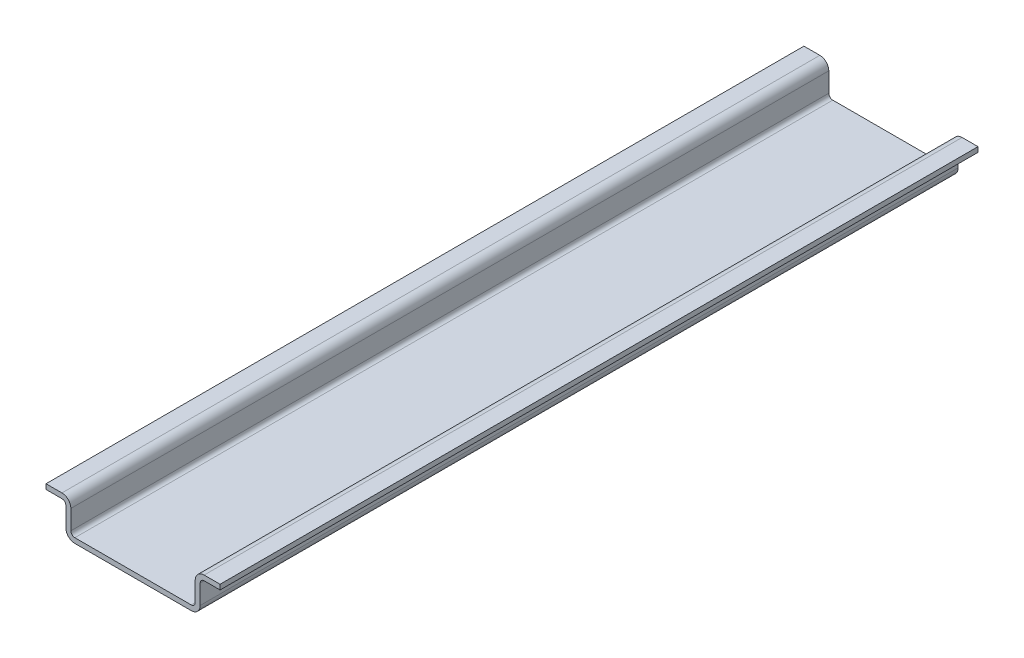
ISO-10303-21;
HEADER;
FILE_DESCRIPTION(('STEP AP214'),'2;1');
FILE_NAME('part.step','',(''),(''),'','','');
FILE_SCHEMA(('AUTOMOTIVE_DESIGN { 1 0 10303 214 1 1 1 1 }'));
ENDSEC;
DATA;
#1=APPLICATION_CONTEXT('core data for automotive mechanical design processes');
#2=APPLICATION_PROTOCOL_DEFINITION('international standard','automotive_design',2000,#1);
#3=PRODUCT_CONTEXT('',#1,'mechanical');
#4=PRODUCT('Part','Part','',(#3));
#5=PRODUCT_RELATED_PRODUCT_CATEGORY('part','',(#4));
#6=PRODUCT_DEFINITION_FORMATION('','',#4);
#7=PRODUCT_DEFINITION_CONTEXT('part definition',#1,'design');
#8=PRODUCT_DEFINITION('design','',#6,#7);
#9=PRODUCT_DEFINITION_SHAPE('','',#8);
#10=(LENGTH_UNIT() NAMED_UNIT(*) SI_UNIT(.MILLI.,.METRE.));
#11=(NAMED_UNIT(*) PLANE_ANGLE_UNIT() SI_UNIT($,.RADIAN.));
#12=(NAMED_UNIT(*) SI_UNIT($,.STERADIAN.) SOLID_ANGLE_UNIT());
#13=UNCERTAINTY_MEASURE_WITH_UNIT(LENGTH_MEASURE(1.E-05),#10,'distance_accuracy_value','');
#14=(GEOMETRIC_REPRESENTATION_CONTEXT(3) GLOBAL_UNCERTAINTY_ASSIGNED_CONTEXT((#13)) GLOBAL_UNIT_ASSIGNED_CONTEXT((#10,
#11,#12)) REPRESENTATION_CONTEXT('',''));
#15=CARTESIAN_POINT('',(0.,0.,0.));
#16=DIRECTION('',(0.,0.,1.));
#17=DIRECTION('',(1.,0.,0.));
#18=AXIS2_PLACEMENT_3D('',#15,#16,#17);
#19=CARTESIAN_POINT('',(17.5,7.5,76.2));
#20=DIRECTION('',(-1.,0.,0.));
#21=DIRECTION('',(0.,0.,1.));
#22=AXIS2_PLACEMENT_3D('',#19,#20,#21);
#23=PLANE('',#22);
#24=DIRECTION('',(0.,1.,0.));
#25=VECTOR('',#24,1.);
#26=CARTESIAN_POINT('',(17.5,7.5,-76.2));
#27=LINE('',#26,#25);
#28=CARTESIAN_POINT('',(17.5,6.5,-76.2));
#29=VERTEX_POINT('',#28);
#30=CARTESIAN_POINT('',(17.5,7.5,-76.2));
#31=VERTEX_POINT('',#30);
#32=EDGE_CURVE('E174',#29,#31,#27,.T.);
#33=ORIENTED_EDGE('',*,*,#32,.T.);
#34=DIRECTION('',(0.,0.,-1.));
#35=VECTOR('',#34,1.);
#36=CARTESIAN_POINT('',(17.5,7.5,76.2));
#37=LINE('',#36,#35);
#38=CARTESIAN_POINT('',(17.5,7.5,76.2));
#39=VERTEX_POINT('',#38);
#40=EDGE_CURVE('E11',#39,#31,#37,.T.);
#41=ORIENTED_EDGE('',*,*,#40,.F.);
#42=DIRECTION('',(0.,1.,0.));
#43=VECTOR('',#42,1.);
#44=CARTESIAN_POINT('',(17.5,7.5,76.2));
#45=LINE('',#44,#43);
#46=CARTESIAN_POINT('',(17.5,6.5,76.2));
#47=VERTEX_POINT('',#46);
#48=EDGE_CURVE('E225',#47,#39,#45,.T.);
#49=ORIENTED_EDGE('',*,*,#48,.F.);
#50=DIRECTION('',(0.,0.,-1.));
#51=VECTOR('',#50,1.);
#52=CARTESIAN_POINT('',(17.5,6.5,76.2));
#53=LINE('',#52,#51);
#54=EDGE_CURVE('E187',#47,#29,#53,.T.);
#55=ORIENTED_EDGE('',*,*,#54,.T.);
#56=EDGE_LOOP('',(#33,#41,#49,#55));
#57=FACE_BOUND('',#56,.T.);
#58=ADVANCED_FACE('F34',(#57),#23,.F.);
#59=CARTESIAN_POINT('',(14.3,7.5,76.2));
#60=DIRECTION('',(0.,-1.,0.));
#61=DIRECTION('',(0.,0.,-1.));
#62=AXIS2_PLACEMENT_3D('',#59,#60,#61);
#63=PLANE('',#62);
#64=DIRECTION('',(-1.,0.,0.));
#65=VECTOR('',#64,1.);
#66=CARTESIAN_POINT('',(14.3,7.5,-76.2));
#67=LINE('',#66,#65);
#68=CARTESIAN_POINT('',(14.3,7.5,-76.2));
#69=VERTEX_POINT('',#68);
#70=EDGE_CURVE('E170',#31,#69,#67,.T.);
#71=ORIENTED_EDGE('',*,*,#70,.T.);
#72=DIRECTION('',(0.,0.,-1.));
#73=VECTOR('',#72,1.);
#74=CARTESIAN_POINT('',(14.3,7.5,76.2));
#75=LINE('',#74,#73);
#76=CARTESIAN_POINT('',(14.3,7.5,76.2));
#77=VERTEX_POINT('',#76);
#78=EDGE_CURVE('E41',#77,#69,#75,.T.);
#79=ORIENTED_EDGE('',*,*,#78,.F.);
#80=DIRECTION('',(-1.,0.,0.));
#81=VECTOR('',#80,1.);
#82=CARTESIAN_POINT('',(14.3,7.5,76.2));
#83=LINE('',#82,#81);
#84=EDGE_CURVE('E183',#39,#77,#83,.T.);
#85=ORIENTED_EDGE('',*,*,#84,.F.);
#86=ORIENTED_EDGE('',*,*,#40,.T.);
#87=EDGE_LOOP('',(#71,#79,#85,#86));
#88=FACE_BOUND('',#87,.T.);
#89=ADVANCED_FACE('F182',(#88),#63,.F.);
#90=CARTESIAN_POINT('',(14.3,5.7,76.2));
#91=DIRECTION('',(0.,0.,-1.));
#92=DIRECTION('',(-1.,0.,0.));
#93=AXIS2_PLACEMENT_3D('',#90,#91,#92);
#94=CYLINDRICAL_SURFACE('',#93,1.8);
#95=CARTESIAN_POINT('',(14.3,5.7,-76.2));
#96=DIRECTION('',(0.,0.,1.));
#97=DIRECTION('',(-1.,0.,0.));
#98=AXIS2_PLACEMENT_3D('',#95,#96,#97);
#99=CIRCLE('',#98,1.8);
#100=CARTESIAN_POINT('',(12.5,5.7,-76.2));
#101=VERTEX_POINT('',#100);
#102=EDGE_CURVE('E176',#69,#101,#99,.T.);
#103=ORIENTED_EDGE('',*,*,#102,.T.);
#104=DIRECTION('',(0.,0.,-1.));
#105=VECTOR('',#104,1.);
#106=CARTESIAN_POINT('',(12.5,5.7,76.2));
#107=LINE('',#106,#105);
#108=CARTESIAN_POINT('',(12.5,5.7,76.2));
#109=VERTEX_POINT('',#108);
#110=EDGE_CURVE('E311',#109,#101,#107,.T.);
#111=ORIENTED_EDGE('',*,*,#110,.F.);
#112=CARTESIAN_POINT('',(14.3,5.7,76.2));
#113=DIRECTION('',(0.,0.,1.));
#114=DIRECTION('',(-1.,0.,0.));
#115=AXIS2_PLACEMENT_3D('',#112,#113,#114);
#116=CIRCLE('',#115,1.8);
#117=EDGE_CURVE('E228',#77,#109,#116,.T.);
#118=ORIENTED_EDGE('',*,*,#117,.F.);
#119=ORIENTED_EDGE('',*,*,#78,.T.);
#120=EDGE_LOOP('',(#103,#111,#118,#119));
#121=FACE_BOUND('',#120,.T.);
#122=ADVANCED_FACE('F315',(#121),#94,.T.);
#123=CARTESIAN_POINT('',(12.5,1.8,76.2));
#124=DIRECTION('',(1.,0.,0.));
#125=DIRECTION('',(0.,1.,0.));
#126=AXIS2_PLACEMENT_3D('',#123,#124,#125);
#127=PLANE('',#126);
#128=DIRECTION('',(0.,-1.,0.));
#129=VECTOR('',#128,1.);
#130=CARTESIAN_POINT('',(12.5,1.8,-76.2));
#131=LINE('',#130,#129);
#132=CARTESIAN_POINT('',(12.5,1.8,-76.2));
#133=VERTEX_POINT('',#132);
#134=EDGE_CURVE('E191',#101,#133,#131,.T.);
#135=ORIENTED_EDGE('',*,*,#134,.T.);
#136=DIRECTION('',(0.,0.,-1.));
#137=VECTOR('',#136,1.);
#138=CARTESIAN_POINT('',(12.5,1.8,76.2));
#139=LINE('',#138,#137);
#140=CARTESIAN_POINT('',(12.5,1.8,76.2));
#141=VERTEX_POINT('',#140);
#142=EDGE_CURVE('E308',#141,#133,#139,.T.);
#143=ORIENTED_EDGE('',*,*,#142,.F.);
#144=DIRECTION('',(0.,-1.,0.));
#145=VECTOR('',#144,1.);
#146=CARTESIAN_POINT('',(12.5,1.8,76.2));
#147=LINE('',#146,#145);
#148=EDGE_CURVE('E230',#109,#141,#147,.T.);
#149=ORIENTED_EDGE('',*,*,#148,.F.);
#150=ORIENTED_EDGE('',*,*,#110,.T.);
#151=EDGE_LOOP('',(#135,#143,#149,#150));
#152=FACE_BOUND('',#151,.T.);
#153=ADVANCED_FACE('F323',(#152),#127,.F.);
#154=CARTESIAN_POINT('',(11.7,1.8,76.2));
#155=DIRECTION('',(0.,0.,-1.));
#156=DIRECTION('',(-1.,0.,0.));
#157=AXIS2_PLACEMENT_3D('',#154,#155,#156);
#158=CYLINDRICAL_SURFACE('',#157,0.800000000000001);
#159=CARTESIAN_POINT('',(11.7,1.8,-76.2));
#160=DIRECTION('',(0.,0.,-1.));
#161=DIRECTION('',(1.,0.,0.));
#162=AXIS2_PLACEMENT_3D('',#159,#160,#161);
#163=CIRCLE('',#162,0.800000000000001);
#164=CARTESIAN_POINT('',(11.7,0.999999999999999,-76.2));
#165=VERTEX_POINT('',#164);
#166=EDGE_CURVE('E193',#133,#165,#163,.T.);
#167=ORIENTED_EDGE('',*,*,#166,.T.);
#168=DIRECTION('',(0.,0.,-1.));
#169=VECTOR('',#168,1.);
#170=CARTESIAN_POINT('',(11.7,0.999999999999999,76.2));
#171=LINE('',#170,#169);
#172=CARTESIAN_POINT('',(11.7,0.999999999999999,76.2));
#173=VERTEX_POINT('',#172);
#174=EDGE_CURVE('E305',#173,#165,#171,.T.);
#175=ORIENTED_EDGE('',*,*,#174,.F.);
#176=CARTESIAN_POINT('',(11.7,1.8,76.2));
#177=DIRECTION('',(0.,0.,-1.));
#178=DIRECTION('',(1.,0.,0.));
#179=AXIS2_PLACEMENT_3D('',#176,#177,#178);
#180=CIRCLE('',#179,0.800000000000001);
#181=EDGE_CURVE('E232',#141,#173,#180,.T.);
#182=ORIENTED_EDGE('',*,*,#181,.F.);
#183=ORIENTED_EDGE('',*,*,#142,.T.);
#184=EDGE_LOOP('',(#167,#175,#182,#183));
#185=FACE_BOUND('',#184,.T.);
#186=ADVANCED_FACE('F326',(#185),#158,.F.);
#187=CARTESIAN_POINT('',(-11.7,1.,76.2));
#188=DIRECTION('',(0.,-1.,0.));
#189=DIRECTION('',(1.,0.,0.));
#190=AXIS2_PLACEMENT_3D('',#187,#188,#189);
#191=PLANE('',#190);
#192=DIRECTION('',(-1.,0.,0.));
#193=VECTOR('',#192,1.);
#194=CARTESIAN_POINT('',(-11.7,1.,-76.2));
#195=LINE('',#194,#193);
#196=CARTESIAN_POINT('',(-11.7,1.,-76.2));
#197=VERTEX_POINT('',#196);
#198=EDGE_CURVE('E195',#165,#197,#195,.T.);
#199=ORIENTED_EDGE('',*,*,#198,.T.);
#200=DIRECTION('',(0.,0.,-1.));
#201=VECTOR('',#200,1.);
#202=CARTESIAN_POINT('',(-11.7,1.,76.2));
#203=LINE('',#202,#201);
#204=CARTESIAN_POINT('',(-11.7,1.,76.2));
#205=VERTEX_POINT('',#204);
#206=EDGE_CURVE('E302',#205,#197,#203,.T.);
#207=ORIENTED_EDGE('',*,*,#206,.F.);
#208=DIRECTION('',(-1.,0.,0.));
#209=VECTOR('',#208,1.);
#210=CARTESIAN_POINT('',(-11.7,1.,76.2));
#211=LINE('',#210,#209);
#212=EDGE_CURVE('E234',#173,#205,#211,.T.);
#213=ORIENTED_EDGE('',*,*,#212,.F.);
#214=ORIENTED_EDGE('',*,*,#174,.T.);
#215=EDGE_LOOP('',(#199,#207,#213,#214));
#216=FACE_BOUND('',#215,.T.);
#217=ADVANCED_FACE('F331',(#216),#191,.F.);
#218=CARTESIAN_POINT('',(-11.7,1.8,76.2));
#219=DIRECTION('',(0.,0.,-1.));
#220=DIRECTION('',(-1.,0.,0.));
#221=AXIS2_PLACEMENT_3D('',#218,#219,#220);
#222=CYLINDRICAL_SURFACE('',#221,0.800000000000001);
#223=CARTESIAN_POINT('',(-11.7,1.8,-76.2));
#224=DIRECTION('',(0.,0.,-1.));
#225=DIRECTION('',(-1.,0.,0.));
#226=AXIS2_PLACEMENT_3D('',#223,#224,#225);
#227=CIRCLE('',#226,0.800000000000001);
#228=CARTESIAN_POINT('',(-12.5,1.8,-76.2));
#229=VERTEX_POINT('',#228);
#230=EDGE_CURVE('E197',#197,#229,#227,.T.);
#231=ORIENTED_EDGE('',*,*,#230,.T.);
#232=DIRECTION('',(0.,0.,-1.));
#233=VECTOR('',#232,1.);
#234=CARTESIAN_POINT('',(-12.5,1.8,76.2));
#235=LINE('',#234,#233);
#236=CARTESIAN_POINT('',(-12.5,1.8,76.2));
#237=VERTEX_POINT('',#236);
#238=EDGE_CURVE('E299',#237,#229,#235,.T.);
#239=ORIENTED_EDGE('',*,*,#238,.F.);
#240=CARTESIAN_POINT('',(-11.7,1.8,76.2));
#241=DIRECTION('',(0.,0.,-1.));
#242=DIRECTION('',(-1.,0.,0.));
#243=AXIS2_PLACEMENT_3D('',#240,#241,#242);
#244=CIRCLE('',#243,0.800000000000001);
#245=EDGE_CURVE('E236',#205,#237,#244,.T.);
#246=ORIENTED_EDGE('',*,*,#245,.F.);
#247=ORIENTED_EDGE('',*,*,#206,.T.);
#248=EDGE_LOOP('',(#231,#239,#246,#247));
#249=FACE_BOUND('',#248,.T.);
#250=ADVANCED_FACE('F337',(#249),#222,.F.);
#251=CARTESIAN_POINT('',(-12.5,1.8,76.2));
#252=DIRECTION('',(-1.,0.,0.));
#253=DIRECTION('',(0.,-1.,0.));
#254=AXIS2_PLACEMENT_3D('',#251,#252,#253);
#255=PLANE('',#254);
#256=DIRECTION('',(0.,1.,0.));
#257=VECTOR('',#256,1.);
#258=CARTESIAN_POINT('',(-12.5,1.8,-76.2));
#259=LINE('',#258,#257);
#260=CARTESIAN_POINT('',(-12.5,5.7,-76.2));
#261=VERTEX_POINT('',#260);
#262=EDGE_CURVE('E199',#229,#261,#259,.T.);
#263=ORIENTED_EDGE('',*,*,#262,.T.);
#264=DIRECTION('',(0.,0.,-1.));
#265=VECTOR('',#264,1.);
#266=CARTESIAN_POINT('',(-12.5,5.7,76.2));
#267=LINE('',#266,#265);
#268=CARTESIAN_POINT('',(-12.5,5.7,76.2));
#269=VERTEX_POINT('',#268);
#270=EDGE_CURVE('E296',#269,#261,#267,.T.);
#271=ORIENTED_EDGE('',*,*,#270,.F.);
#272=DIRECTION('',(0.,1.,0.));
#273=VECTOR('',#272,1.);
#274=CARTESIAN_POINT('',(-12.5,1.8,76.2));
#275=LINE('',#274,#273);
#276=EDGE_CURVE('E238',#237,#269,#275,.T.);
#277=ORIENTED_EDGE('',*,*,#276,.F.);
#278=ORIENTED_EDGE('',*,*,#238,.T.);
#279=EDGE_LOOP('',(#263,#271,#277,#278));
#280=FACE_BOUND('',#279,.T.);
#281=ADVANCED_FACE('F341',(#280),#255,.F.);
#282=CARTESIAN_POINT('',(-14.3,5.7,76.2));
#283=DIRECTION('',(0.,0.,-1.));
#284=DIRECTION('',(-1.,0.,0.));
#285=AXIS2_PLACEMENT_3D('',#282,#283,#284);
#286=CYLINDRICAL_SURFACE('',#285,1.8);
#287=CARTESIAN_POINT('',(-14.3,5.7,-76.2));
#288=DIRECTION('',(0.,0.,1.));
#289=DIRECTION('',(1.,0.,0.));
#290=AXIS2_PLACEMENT_3D('',#287,#288,#289);
#291=CIRCLE('',#290,1.8);
#292=CARTESIAN_POINT('',(-14.3,7.5,-76.2));
#293=VERTEX_POINT('',#292);
#294=EDGE_CURVE('E201',#261,#293,#291,.T.);
#295=ORIENTED_EDGE('',*,*,#294,.T.);
#296=DIRECTION('',(0.,0.,-1.));
#297=VECTOR('',#296,1.);
#298=CARTESIAN_POINT('',(-14.3,7.5,76.2));
#299=LINE('',#298,#297);
#300=CARTESIAN_POINT('',(-14.3,7.5,76.2));
#301=VERTEX_POINT('',#300);
#302=EDGE_CURVE('E293',#301,#293,#299,.T.);
#303=ORIENTED_EDGE('',*,*,#302,.F.);
#304=CARTESIAN_POINT('',(-14.3,5.7,76.2));
#305=DIRECTION('',(0.,0.,1.));
#306=DIRECTION('',(1.,0.,0.));
#307=AXIS2_PLACEMENT_3D('',#304,#305,#306);
#308=CIRCLE('',#307,1.8);
#309=EDGE_CURVE('E240',#269,#301,#308,.T.);
#310=ORIENTED_EDGE('',*,*,#309,.F.);
#311=ORIENTED_EDGE('',*,*,#270,.T.);
#312=EDGE_LOOP('',(#295,#303,#310,#311));
#313=FACE_BOUND('',#312,.T.);
#314=ADVANCED_FACE('F346',(#313),#286,.T.);
#315=CARTESIAN_POINT('',(-14.3,7.5,76.2));
#316=DIRECTION('',(0.,-1.,0.));
#317=DIRECTION('',(1.,0.,0.));
#318=AXIS2_PLACEMENT_3D('',#315,#316,#317);
#319=PLANE('',#318);
#320=DIRECTION('',(-1.,0.,0.));
#321=VECTOR('',#320,1.);
#322=CARTESIAN_POINT('',(-14.3,7.5,-76.2));
#323=LINE('',#322,#321);
#324=CARTESIAN_POINT('',(-17.5,7.5,-76.2));
#325=VERTEX_POINT('',#324);
#326=EDGE_CURVE('E203',#293,#325,#323,.T.);
#327=ORIENTED_EDGE('',*,*,#326,.T.);
#328=DIRECTION('',(0.,0.,-1.));
#329=VECTOR('',#328,1.);
#330=CARTESIAN_POINT('',(-17.5,7.5,76.2));
#331=LINE('',#330,#329);
#332=CARTESIAN_POINT('',(-17.5,7.5,76.2));
#333=VERTEX_POINT('',#332);
#334=EDGE_CURVE('E290',#333,#325,#331,.T.);
#335=ORIENTED_EDGE('',*,*,#334,.F.);
#336=DIRECTION('',(-1.,0.,0.));
#337=VECTOR('',#336,1.);
#338=CARTESIAN_POINT('',(-14.3,7.5,76.2));
#339=LINE('',#338,#337);
#340=EDGE_CURVE('E242',#301,#333,#339,.T.);
#341=ORIENTED_EDGE('',*,*,#340,.F.);
#342=ORIENTED_EDGE('',*,*,#302,.T.);
#343=EDGE_LOOP('',(#327,#335,#341,#342));
#344=FACE_BOUND('',#343,.T.);
#345=ADVANCED_FACE('F352',(#344),#319,.F.);
#346=CARTESIAN_POINT('',(-17.5,7.5,76.2));
#347=DIRECTION('',(1.,0.,0.));
#348=DIRECTION('',(0.,0.,-1.));
#349=AXIS2_PLACEMENT_3D('',#346,#347,#348);
#350=PLANE('',#349);
#351=DIRECTION('',(0.,-1.,0.));
#352=VECTOR('',#351,1.);
#353=CARTESIAN_POINT('',(-17.5,7.5,-76.2));
#354=LINE('',#353,#352);
#355=CARTESIAN_POINT('',(-17.5,6.5,-76.2));
#356=VERTEX_POINT('',#355);
#357=EDGE_CURVE('E205',#325,#356,#354,.T.);
#358=ORIENTED_EDGE('',*,*,#357,.T.);
#359=DIRECTION('',(0.,0.,-1.));
#360=VECTOR('',#359,1.);
#361=CARTESIAN_POINT('',(-17.5,6.5,76.2));
#362=LINE('',#361,#360);
#363=CARTESIAN_POINT('',(-17.5,6.5,76.2));
#364=VERTEX_POINT('',#363);
#365=EDGE_CURVE('E287',#364,#356,#362,.T.);
#366=ORIENTED_EDGE('',*,*,#365,.F.);
#367=DIRECTION('',(0.,-1.,0.));
#368=VECTOR('',#367,1.);
#369=CARTESIAN_POINT('',(-17.5,7.5,76.2));
#370=LINE('',#369,#368);
#371=EDGE_CURVE('E244',#333,#364,#370,.T.);
#372=ORIENTED_EDGE('',*,*,#371,.F.);
#373=ORIENTED_EDGE('',*,*,#334,.T.);
#374=EDGE_LOOP('',(#358,#366,#372,#373));
#375=FACE_BOUND('',#374,.T.);
#376=ADVANCED_FACE('F356',(#375),#350,.F.);
#377=CARTESIAN_POINT('',(-14.3,6.5,76.2));
#378=DIRECTION('',(0.,1.,0.));
#379=DIRECTION('',(-1.,0.,0.));
#380=AXIS2_PLACEMENT_3D('',#377,#378,#379);
#381=PLANE('',#380);
#382=DIRECTION('',(1.,0.,0.));
#383=VECTOR('',#382,1.);
#384=CARTESIAN_POINT('',(-14.3,6.5,-76.2));
#385=LINE('',#384,#383);
#386=CARTESIAN_POINT('',(-14.3,6.5,-76.2));
#387=VERTEX_POINT('',#386);
#388=EDGE_CURVE('E207',#356,#387,#385,.T.);
#389=ORIENTED_EDGE('',*,*,#388,.T.);
#390=DIRECTION('',(0.,0.,-1.));
#391=VECTOR('',#390,1.);
#392=CARTESIAN_POINT('',(-14.3,6.5,76.2));
#393=LINE('',#392,#391);
#394=CARTESIAN_POINT('',(-14.3,6.5,76.2));
#395=VERTEX_POINT('',#394);
#396=EDGE_CURVE('E284',#395,#387,#393,.T.);
#397=ORIENTED_EDGE('',*,*,#396,.F.);
#398=DIRECTION('',(1.,0.,0.));
#399=VECTOR('',#398,1.);
#400=CARTESIAN_POINT('',(-14.3,6.5,76.2));
#401=LINE('',#400,#399);
#402=EDGE_CURVE('E246',#364,#395,#401,.T.);
#403=ORIENTED_EDGE('',*,*,#402,.F.);
#404=ORIENTED_EDGE('',*,*,#365,.T.);
#405=EDGE_LOOP('',(#389,#397,#403,#404));
#406=FACE_BOUND('',#405,.T.);
#407=ADVANCED_FACE('F361',(#406),#381,.F.);
#408=CARTESIAN_POINT('',(-14.3,5.7,76.2));
#409=DIRECTION('',(0.,0.,-1.));
#410=DIRECTION('',(-1.,0.,0.));
#411=AXIS2_PLACEMENT_3D('',#408,#409,#410);
#412=CYLINDRICAL_SURFACE('',#411,0.799999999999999);
#413=CARTESIAN_POINT('',(-14.3,5.7,-76.2));
#414=DIRECTION('',(0.,0.,-1.));
#415=DIRECTION('',(1.,0.,0.));
#416=AXIS2_PLACEMENT_3D('',#413,#414,#415);
#417=CIRCLE('',#416,0.799999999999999);
#418=CARTESIAN_POINT('',(-13.5,5.7,-76.2));
#419=VERTEX_POINT('',#418);
#420=EDGE_CURVE('E209',#387,#419,#417,.T.);
#421=ORIENTED_EDGE('',*,*,#420,.T.);
#422=DIRECTION('',(0.,0.,-1.));
#423=VECTOR('',#422,1.);
#424=CARTESIAN_POINT('',(-13.5,5.7,76.2));
#425=LINE('',#424,#423);
#426=CARTESIAN_POINT('',(-13.5,5.7,76.2));
#427=VERTEX_POINT('',#426);
#428=EDGE_CURVE('E281',#427,#419,#425,.T.);
#429=ORIENTED_EDGE('',*,*,#428,.F.);
#430=CARTESIAN_POINT('',(-14.3,5.7,76.2));
#431=DIRECTION('',(0.,0.,-1.));
#432=DIRECTION('',(1.,0.,0.));
#433=AXIS2_PLACEMENT_3D('',#430,#431,#432);
#434=CIRCLE('',#433,0.799999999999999);
#435=EDGE_CURVE('E248',#395,#427,#434,.T.);
#436=ORIENTED_EDGE('',*,*,#435,.F.);
#437=ORIENTED_EDGE('',*,*,#396,.T.);
#438=EDGE_LOOP('',(#421,#429,#436,#437));
#439=FACE_BOUND('',#438,.T.);
#440=ADVANCED_FACE('F367',(#439),#412,.F.);
#441=CARTESIAN_POINT('',(-13.5,1.8,76.2));
#442=DIRECTION('',(1.,0.,0.));
#443=DIRECTION('',(0.,0.,-1.));
#444=AXIS2_PLACEMENT_3D('',#441,#442,#443);
#445=PLANE('',#444);
#446=DIRECTION('',(0.,-1.,0.));
#447=VECTOR('',#446,1.);
#448=CARTESIAN_POINT('',(-13.5,1.8,-76.2));
#449=LINE('',#448,#447);
#450=CARTESIAN_POINT('',(-13.5,1.8,-76.2));
#451=VERTEX_POINT('',#450);
#452=EDGE_CURVE('E211',#419,#451,#449,.T.);
#453=ORIENTED_EDGE('',*,*,#452,.T.);
#454=DIRECTION('',(0.,0.,-1.));
#455=VECTOR('',#454,1.);
#456=CARTESIAN_POINT('',(-13.5,1.8,76.2));
#457=LINE('',#456,#455);
#458=CARTESIAN_POINT('',(-13.5,1.8,76.2));
#459=VERTEX_POINT('',#458);
#460=EDGE_CURVE('E278',#459,#451,#457,.T.);
#461=ORIENTED_EDGE('',*,*,#460,.F.);
#462=DIRECTION('',(0.,-1.,0.));
#463=VECTOR('',#462,1.);
#464=CARTESIAN_POINT('',(-13.5,1.8,76.2));
#465=LINE('',#464,#463);
#466=EDGE_CURVE('E250',#427,#459,#465,.T.);
#467=ORIENTED_EDGE('',*,*,#466,.F.);
#468=ORIENTED_EDGE('',*,*,#428,.T.);
#469=EDGE_LOOP('',(#453,#461,#467,#468));
#470=FACE_BOUND('',#469,.T.);
#471=ADVANCED_FACE('F371',(#470),#445,.F.);
#472=CARTESIAN_POINT('',(-11.7,1.8,76.2));
#473=DIRECTION('',(0.,0.,-1.));
#474=DIRECTION('',(-1.,0.,0.));
#475=AXIS2_PLACEMENT_3D('',#472,#473,#474);
#476=CYLINDRICAL_SURFACE('',#475,1.8);
#477=CARTESIAN_POINT('',(-11.7,1.8,-76.2));
#478=DIRECTION('',(0.,0.,1.));
#479=DIRECTION('',(-1.,0.,0.));
#480=AXIS2_PLACEMENT_3D('',#477,#478,#479);
#481=CIRCLE('',#480,1.8);
#482=CARTESIAN_POINT('',(-11.7,0.,-76.2));
#483=VERTEX_POINT('',#482);
#484=EDGE_CURVE('E213',#451,#483,#481,.T.);
#485=ORIENTED_EDGE('',*,*,#484,.T.);
#486=DIRECTION('',(0.,0.,-1.));
#487=VECTOR('',#486,1.);
#488=CARTESIAN_POINT('',(-11.7,0.,76.2));
#489=LINE('',#488,#487);
#490=CARTESIAN_POINT('',(-11.7,0.,76.2));
#491=VERTEX_POINT('',#490);
#492=EDGE_CURVE('E275',#491,#483,#489,.T.);
#493=ORIENTED_EDGE('',*,*,#492,.F.);
#494=CARTESIAN_POINT('',(-11.7,1.8,76.2));
#495=DIRECTION('',(0.,0.,1.));
#496=DIRECTION('',(-1.,0.,0.));
#497=AXIS2_PLACEMENT_3D('',#494,#495,#496);
#498=CIRCLE('',#497,1.8);
#499=EDGE_CURVE('E252',#459,#491,#498,.T.);
#500=ORIENTED_EDGE('',*,*,#499,.F.);
#501=ORIENTED_EDGE('',*,*,#460,.T.);
#502=EDGE_LOOP('',(#485,#493,#500,#501));
#503=FACE_BOUND('',#502,.T.);
#504=ADVANCED_FACE('F376',(#503),#476,.T.);
#505=CARTESIAN_POINT('',(-11.7,0.,76.2));
#506=DIRECTION('',(0.,1.,0.));
#507=DIRECTION('',(-1.,0.,0.));
#508=AXIS2_PLACEMENT_3D('',#505,#506,#507);
#509=PLANE('',#508);
#510=DIRECTION('',(1.,0.,0.));
#511=VECTOR('',#510,1.);
#512=CARTESIAN_POINT('',(-11.7,0.,-76.2));
#513=LINE('',#512,#511);
#514=CARTESIAN_POINT('',(11.7,0.,-76.2));
#515=VERTEX_POINT('',#514);
#516=EDGE_CURVE('E215',#483,#515,#513,.T.);
#517=ORIENTED_EDGE('',*,*,#516,.T.);
#518=DIRECTION('',(0.,0.,-1.));
#519=VECTOR('',#518,1.);
#520=CARTESIAN_POINT('',(11.7,0.,76.2));
#521=LINE('',#520,#519);
#522=CARTESIAN_POINT('',(11.7,0.,76.2));
#523=VERTEX_POINT('',#522);
#524=EDGE_CURVE('E272',#523,#515,#521,.T.);
#525=ORIENTED_EDGE('',*,*,#524,.F.);
#526=DIRECTION('',(1.,0.,0.));
#527=VECTOR('',#526,1.);
#528=CARTESIAN_POINT('',(-11.7,0.,76.2));
#529=LINE('',#528,#527);
#530=EDGE_CURVE('E254',#491,#523,#529,.T.);
#531=ORIENTED_EDGE('',*,*,#530,.F.);
#532=ORIENTED_EDGE('',*,*,#492,.T.);
#533=EDGE_LOOP('',(#517,#525,#531,#532));
#534=FACE_BOUND('',#533,.T.);
#535=ADVANCED_FACE('F382',(#534),#509,.F.);
#536=CARTESIAN_POINT('',(11.7,1.8,76.2));
#537=DIRECTION('',(0.,0.,-1.));
#538=DIRECTION('',(-1.,0.,0.));
#539=AXIS2_PLACEMENT_3D('',#536,#537,#538);
#540=CYLINDRICAL_SURFACE('',#539,1.8);
#541=CARTESIAN_POINT('',(11.7,1.8,-76.2));
#542=DIRECTION('',(0.,0.,1.));
#543=DIRECTION('',(1.,0.,0.));
#544=AXIS2_PLACEMENT_3D('',#541,#542,#543);
#545=CIRCLE('',#544,1.8);
#546=CARTESIAN_POINT('',(13.5,1.8,-76.2));
#547=VERTEX_POINT('',#546);
#548=EDGE_CURVE('E217',#515,#547,#545,.T.);
#549=ORIENTED_EDGE('',*,*,#548,.T.);
#550=DIRECTION('',(0.,0.,-1.));
#551=VECTOR('',#550,1.);
#552=CARTESIAN_POINT('',(13.5,1.8,76.2));
#553=LINE('',#552,#551);
#554=CARTESIAN_POINT('',(13.5,1.8,76.2));
#555=VERTEX_POINT('',#554);
#556=EDGE_CURVE('E269',#555,#547,#553,.T.);
#557=ORIENTED_EDGE('',*,*,#556,.F.);
#558=CARTESIAN_POINT('',(11.7,1.8,76.2));
#559=DIRECTION('',(0.,0.,1.));
#560=DIRECTION('',(1.,0.,0.));
#561=AXIS2_PLACEMENT_3D('',#558,#559,#560);
#562=CIRCLE('',#561,1.8);
#563=EDGE_CURVE('E256',#523,#555,#562,.T.);
#564=ORIENTED_EDGE('',*,*,#563,.F.);
#565=ORIENTED_EDGE('',*,*,#524,.T.);
#566=EDGE_LOOP('',(#549,#557,#564,#565));
#567=FACE_BOUND('',#566,.T.);
#568=ADVANCED_FACE('F386',(#567),#540,.T.);
#569=CARTESIAN_POINT('',(13.5,1.8,76.2));
#570=DIRECTION('',(-1.,0.,0.));
#571=DIRECTION('',(0.,0.,1.));
#572=AXIS2_PLACEMENT_3D('',#569,#570,#571);
#573=PLANE('',#572);
#574=DIRECTION('',(0.,1.,0.));
#575=VECTOR('',#574,1.);
#576=CARTESIAN_POINT('',(13.5,1.8,-76.2));
#577=LINE('',#576,#575);
#578=CARTESIAN_POINT('',(13.5,5.7,-76.2));
#579=VERTEX_POINT('',#578);
#580=EDGE_CURVE('E219',#547,#579,#577,.T.);
#581=ORIENTED_EDGE('',*,*,#580,.T.);
#582=DIRECTION('',(0.,0.,-1.));
#583=VECTOR('',#582,1.);
#584=CARTESIAN_POINT('',(13.5,5.7,76.2));
#585=LINE('',#584,#583);
#586=CARTESIAN_POINT('',(13.5,5.7,76.2));
#587=VERTEX_POINT('',#586);
#588=EDGE_CURVE('E266',#587,#579,#585,.T.);
#589=ORIENTED_EDGE('',*,*,#588,.F.);
#590=DIRECTION('',(0.,1.,0.));
#591=VECTOR('',#590,1.);
#592=CARTESIAN_POINT('',(13.5,1.8,76.2));
#593=LINE('',#592,#591);
#594=EDGE_CURVE('E258',#555,#587,#593,.T.);
#595=ORIENTED_EDGE('',*,*,#594,.F.);
#596=ORIENTED_EDGE('',*,*,#556,.T.);
#597=EDGE_LOOP('',(#581,#589,#595,#596));
#598=FACE_BOUND('',#597,.T.);
#599=ADVANCED_FACE('F391',(#598),#573,.F.);
#600=CARTESIAN_POINT('',(14.3,5.7,76.2));
#601=DIRECTION('',(0.,0.,-1.));
#602=DIRECTION('',(-1.,0.,0.));
#603=AXIS2_PLACEMENT_3D('',#600,#601,#602);
#604=CYLINDRICAL_SURFACE('',#603,0.799999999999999);
#605=CARTESIAN_POINT('',(14.3,5.7,-76.2));
#606=DIRECTION('',(0.,0.,-1.));
#607=DIRECTION('',(-1.,0.,0.));
#608=AXIS2_PLACEMENT_3D('',#605,#606,#607);
#609=CIRCLE('',#608,0.799999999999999);
#610=CARTESIAN_POINT('',(14.3,6.5,-76.2));
#611=VERTEX_POINT('',#610);
#612=EDGE_CURVE('E221',#579,#611,#609,.T.);
#613=ORIENTED_EDGE('',*,*,#612,.T.);
#614=DIRECTION('',(0.,0.,-1.));
#615=VECTOR('',#614,1.);
#616=CARTESIAN_POINT('',(14.3,6.5,76.2));
#617=LINE('',#616,#615);
#618=CARTESIAN_POINT('',(14.3,6.5,76.2));
#619=VERTEX_POINT('',#618);
#620=EDGE_CURVE('E263',#619,#611,#617,.T.);
#621=ORIENTED_EDGE('',*,*,#620,.F.);
#622=CARTESIAN_POINT('',(14.3,5.7,76.2));
#623=DIRECTION('',(0.,0.,-1.));
#624=DIRECTION('',(-1.,0.,0.));
#625=AXIS2_PLACEMENT_3D('',#622,#623,#624);
#626=CIRCLE('',#625,0.799999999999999);
#627=EDGE_CURVE('E53',#587,#619,#626,.T.);
#628=ORIENTED_EDGE('',*,*,#627,.F.);
#629=ORIENTED_EDGE('',*,*,#588,.T.);
#630=EDGE_LOOP('',(#613,#621,#628,#629));
#631=FACE_BOUND('',#630,.T.);
#632=ADVANCED_FACE('F394',(#631),#604,.F.);
#633=CARTESIAN_POINT('',(14.3,6.5,76.2));
#634=DIRECTION('',(0.,1.,0.));
#635=DIRECTION('',(-1.,0.,0.));
#636=AXIS2_PLACEMENT_3D('',#633,#634,#635);
#637=PLANE('',#636);
#638=DIRECTION('',(1.,0.,0.));
#639=VECTOR('',#638,1.);
#640=CARTESIAN_POINT('',(14.3,6.5,-76.2));
#641=LINE('',#640,#639);
#642=EDGE_CURVE('E223',#611,#29,#641,.T.);
#643=ORIENTED_EDGE('',*,*,#642,.T.);
#644=ORIENTED_EDGE('',*,*,#54,.F.);
#645=DIRECTION('',(1.,0.,0.));
#646=VECTOR('',#645,1.);
#647=CARTESIAN_POINT('',(14.3,6.5,76.2));
#648=LINE('',#647,#646);
#649=EDGE_CURVE('E48',#619,#47,#648,.T.);
#650=ORIENTED_EDGE('',*,*,#649,.F.);
#651=ORIENTED_EDGE('',*,*,#620,.T.);
#652=EDGE_LOOP('',(#643,#644,#650,#651));
#653=FACE_BOUND('',#652,.T.);
#654=ADVANCED_FACE('F396',(#653),#637,.F.);
#655=CARTESIAN_POINT('',(14.3,5.7,76.2));
#656=DIRECTION('',(0.,0.,-1.));
#657=DIRECTION('',(-1.,0.,0.));
#658=AXIS2_PLACEMENT_3D('',#655,#656,#657);
#659=PLANE('',#658);
#660=ORIENTED_EDGE('',*,*,#48,.T.);
#661=ORIENTED_EDGE('',*,*,#84,.T.);
#662=ORIENTED_EDGE('',*,*,#117,.T.);
#663=ORIENTED_EDGE('',*,*,#148,.T.);
#664=ORIENTED_EDGE('',*,*,#181,.T.);
#665=ORIENTED_EDGE('',*,*,#212,.T.);
#666=ORIENTED_EDGE('',*,*,#245,.T.);
#667=ORIENTED_EDGE('',*,*,#276,.T.);
#668=ORIENTED_EDGE('',*,*,#309,.T.);
#669=ORIENTED_EDGE('',*,*,#340,.T.);
#670=ORIENTED_EDGE('',*,*,#371,.T.);
#671=ORIENTED_EDGE('',*,*,#402,.T.);
#672=ORIENTED_EDGE('',*,*,#435,.T.);
#673=ORIENTED_EDGE('',*,*,#466,.T.);
#674=ORIENTED_EDGE('',*,*,#499,.T.);
#675=ORIENTED_EDGE('',*,*,#530,.T.);
#676=ORIENTED_EDGE('',*,*,#563,.T.);
#677=ORIENTED_EDGE('',*,*,#594,.T.);
#678=ORIENTED_EDGE('',*,*,#627,.T.);
#679=ORIENTED_EDGE('',*,*,#649,.T.);
#680=EDGE_LOOP('',(#660,#661,#662,#663,#664,#665,#666,#667,#668,#669,#670,#671,#672,#673,#674,
#675,#676,#677,#678,#679));
#681=FACE_BOUND('',#680,.T.);
#682=ADVANCED_FACE('F318',(#681),#659,.F.);
#683=CARTESIAN_POINT('',(14.3,5.7,-76.2));
#684=DIRECTION('',(0.,0.,-1.));
#685=DIRECTION('',(-1.,0.,0.));
#686=AXIS2_PLACEMENT_3D('',#683,#684,#685);
#687=PLANE('',#686);
#688=ORIENTED_EDGE('',*,*,#32,.F.);
#689=ORIENTED_EDGE('',*,*,#642,.F.);
#690=ORIENTED_EDGE('',*,*,#612,.F.);
#691=ORIENTED_EDGE('',*,*,#580,.F.);
#692=ORIENTED_EDGE('',*,*,#548,.F.);
#693=ORIENTED_EDGE('',*,*,#516,.F.);
#694=ORIENTED_EDGE('',*,*,#484,.F.);
#695=ORIENTED_EDGE('',*,*,#452,.F.);
#696=ORIENTED_EDGE('',*,*,#420,.F.);
#697=ORIENTED_EDGE('',*,*,#388,.F.);
#698=ORIENTED_EDGE('',*,*,#357,.F.);
#699=ORIENTED_EDGE('',*,*,#326,.F.);
#700=ORIENTED_EDGE('',*,*,#294,.F.);
#701=ORIENTED_EDGE('',*,*,#262,.F.);
#702=ORIENTED_EDGE('',*,*,#230,.F.);
#703=ORIENTED_EDGE('',*,*,#198,.F.);
#704=ORIENTED_EDGE('',*,*,#166,.F.);
#705=ORIENTED_EDGE('',*,*,#134,.F.);
#706=ORIENTED_EDGE('',*,*,#102,.F.);
#707=ORIENTED_EDGE('',*,*,#70,.F.);
#708=EDGE_LOOP('',(#688,#689,#690,#691,#692,#693,#694,#695,#696,#697,#698,#699,#700,#701,#702,
#703,#704,#705,#706,#707));
#709=FACE_BOUND('',#708,.T.);
#710=ADVANCED_FACE('F171',(#709),#687,.T.);
#711=CLOSED_SHELL('',(#58,#89,#122,#153,#186,#217,#250,#281,#314,#345,#376,#407,#440,#471,#504,
#535,#568,#599,#632,#654,#682,#710));
#712=MANIFOLD_SOLID_BREP('B2',#711);
#713=ADVANCED_BREP_SHAPE_REPRESENTATION('',(#18,#712),#14);
#714=SHAPE_DEFINITION_REPRESENTATION(#9,#713);
ENDSEC;
END-ISO-10303-21;
